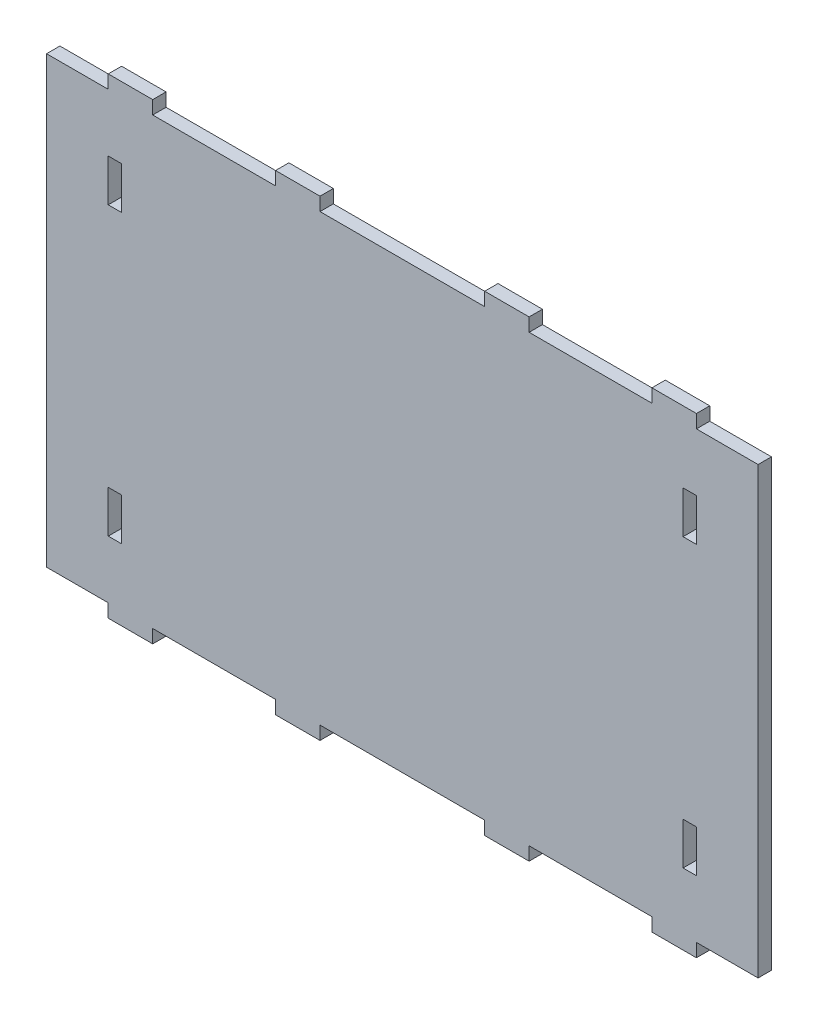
from build123d import *

# Parameters (mm, degrees)
BOSS_EXTRU_1_DEPTH      = 3
ESQUISSE2_W             = 3
ESQUISSE2_H             = 9.506842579
ENL_V_MAT_EXTRU_1_DEPTH = 3


with BuildPart() as part:
    # Esquisse1 → Boss.-Extru.1 (new body)
    with BuildSketch(Plane.XY):
        Polygon((-80, 0), (-66.130511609, 0), (-66.130511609, -3), (-56.130511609, -3), (-56.130511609, 0), (-28.511151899, 0), (-28.511151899, -3), (-18.511151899, -3), (-18.511151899, 0), (18.511151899, 0), (18.511151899, -3), (28.511151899, -3), (28.511151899, 0), (56.130511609, 0), (56.130511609, -3), (66.130511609, -3), (66.130511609, 0), (80, 0), (80, 100), (66.130511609, 100), (66.130511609, 103), (56.130511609, 103), (56.130511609, 100), (28.511151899, 100), (28.511151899, 103), (18.511151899, 103), (18.511151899, 100), (-18.511151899, 100), (-18.511151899, 103), (-28.511151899, 103), (-28.511151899, 100), (-56.130511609, 100), (-56.130511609, 103), (-66.130511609, 103), (-66.130511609, 100), (-80, 100), align=None)
    extrude(amount=BOSS_EXTRU_1_DEPTH)

    # Esquisse2 → Enl_v. mat.-Extru.1 (cut)
    with BuildSketch(Plane.XY.offset(3)):
        with Locations((64.630511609, 17.739426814)):
            Rectangle(ESQUISSE2_W, ESQUISSE2_H)
        with Locations((-64.630511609, 17.739426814)):
            Rectangle(ESQUISSE2_W, ESQUISSE2_H)
        with Locations((64.630511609, 82.260573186)):
            Rectangle(ESQUISSE2_W, ESQUISSE2_H)
        with Locations((-64.630511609, 82.260573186)):
            Rectangle(ESQUISSE2_W, ESQUISSE2_H)
    extrude(amount=-ENL_V_MAT_EXTRU_1_DEPTH, mode=Mode.SUBTRACT)


solid = part.part
